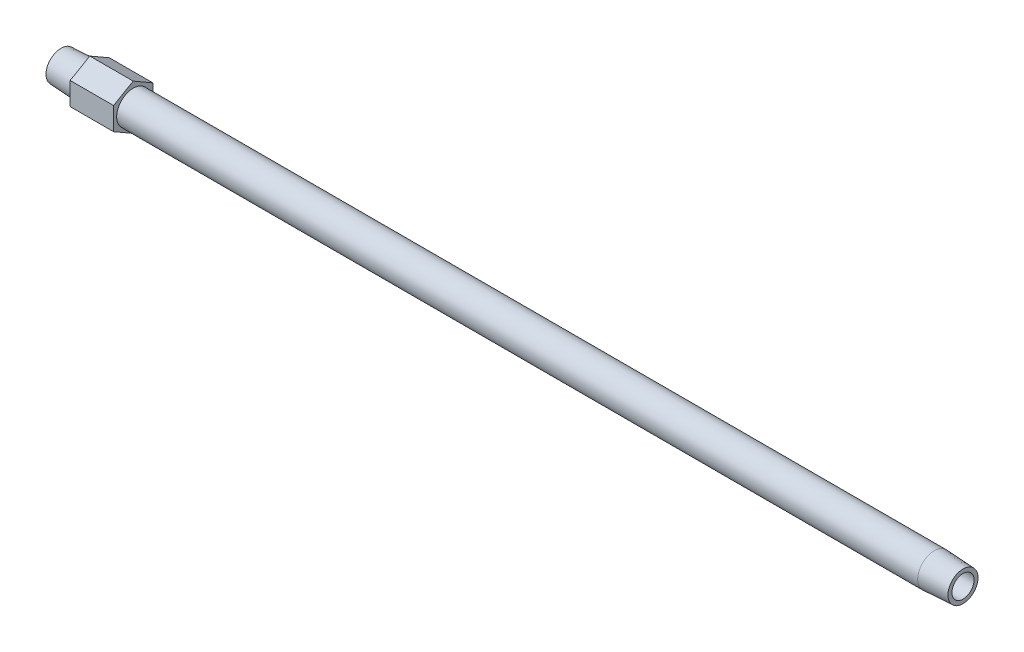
ISO-10303-21;
HEADER;
FILE_DESCRIPTION(('STEP AP214'),'2;1');
FILE_NAME('part.step','',(''),(''),'','','');
FILE_SCHEMA(('AUTOMOTIVE_DESIGN { 1 0 10303 214 1 1 1 1 }'));
ENDSEC;
DATA;
#1=APPLICATION_CONTEXT('core data for automotive mechanical design processes');
#2=APPLICATION_PROTOCOL_DEFINITION('international standard','automotive_design',2000,#1);
#3=PRODUCT_CONTEXT('',#1,'mechanical');
#4=PRODUCT('Part','Part','',(#3));
#5=PRODUCT_RELATED_PRODUCT_CATEGORY('part','',(#4));
#6=PRODUCT_DEFINITION_FORMATION('','',#4);
#7=PRODUCT_DEFINITION_CONTEXT('part definition',#1,'design');
#8=PRODUCT_DEFINITION('design','',#6,#7);
#9=PRODUCT_DEFINITION_SHAPE('','',#8);
#10=(LENGTH_UNIT() NAMED_UNIT(*) SI_UNIT(.MILLI.,.METRE.));
#11=(NAMED_UNIT(*) PLANE_ANGLE_UNIT() SI_UNIT($,.RADIAN.));
#12=(NAMED_UNIT(*) SI_UNIT($,.STERADIAN.) SOLID_ANGLE_UNIT());
#13=UNCERTAINTY_MEASURE_WITH_UNIT(LENGTH_MEASURE(1.E-05),#10,'distance_accuracy_value','');
#14=(GEOMETRIC_REPRESENTATION_CONTEXT(3) GLOBAL_UNCERTAINTY_ASSIGNED_CONTEXT((#13)) GLOBAL_UNIT_ASSIGNED_CONTEXT((#10,
#11,#12)) REPRESENTATION_CONTEXT('',''));
#15=CARTESIAN_POINT('',(0.,0.,0.));
#16=DIRECTION('',(0.,0.,1.));
#17=DIRECTION('',(1.,0.,0.));
#18=AXIS2_PLACEMENT_3D('',#15,#16,#17);
#19=CARTESIAN_POINT('',(0.,0.,-3.59899397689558));
#20=DIRECTION('',(1.,0.,0.));
#21=DIRECTION('',(0.,0.,-1.));
#22=AXIS2_PLACEMENT_3D('',#19,#20,#21);
#23=PLANE('',#22);
#24=CARTESIAN_POINT('',(0.,0.,0.));
#25=DIRECTION('',(-1.,0.,0.));
#26=DIRECTION('',(0.,0.,1.));
#27=AXIS2_PLACEMENT_3D('',#24,#25,#26);
#28=CIRCLE('',#27,3.59899397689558);
#29=CARTESIAN_POINT('',(0.,0.,3.59899397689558));
#30=VERTEX_POINT('',#29);
#31=EDGE_CURVE('E147',#30,#30,#28,.T.);
#32=ORIENTED_EDGE('',*,*,#31,.T.);
#33=EDGE_LOOP('',(#32));
#34=FACE_BOUND('',#33,.T.);
#35=CARTESIAN_POINT('',(0.,0.,0.));
#36=DIRECTION('',(1.,0.,0.));
#37=DIRECTION('',(0.,0.,1.));
#38=AXIS2_PLACEMENT_3D('',#35,#36,#37);
#39=CIRCLE('',#38,2.6543);
#40=CARTESIAN_POINT('',(0.,0.,2.6543));
#41=VERTEX_POINT('',#40);
#42=EDGE_CURVE('E159',#41,#41,#39,.T.);
#43=ORIENTED_EDGE('',*,*,#42,.T.);
#44=EDGE_LOOP('',(#43));
#45=FACE_BOUND('',#44,.T.);
#46=ADVANCED_FACE('F15',(#34,#45),#23,.F.);
#47=CARTESIAN_POINT('',(215.9,0.,-3.59899397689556));
#48=DIRECTION('',(-1.,0.,0.));
#49=DIRECTION('',(0.,0.,1.));
#50=AXIS2_PLACEMENT_3D('',#47,#48,#49);
#51=PLANE('',#50);
#52=CARTESIAN_POINT('',(215.9,0.,0.));
#53=DIRECTION('',(-1.,0.,0.));
#54=DIRECTION('',(0.,0.,1.));
#55=AXIS2_PLACEMENT_3D('',#52,#53,#54);
#56=CIRCLE('',#55,3.59899397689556);
#57=CARTESIAN_POINT('',(215.9,0.,3.59899397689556));
#58=VERTEX_POINT('',#57);
#59=EDGE_CURVE('E150',#58,#58,#56,.T.);
#60=ORIENTED_EDGE('',*,*,#59,.F.);
#61=EDGE_LOOP('',(#60));
#62=FACE_BOUND('',#61,.T.);
#63=CARTESIAN_POINT('',(215.9,0.,0.));
#64=DIRECTION('',(-1.,0.,0.));
#65=DIRECTION('',(0.,0.,1.));
#66=AXIS2_PLACEMENT_3D('',#63,#64,#65);
#67=CIRCLE('',#66,2.6543);
#68=CARTESIAN_POINT('',(215.9,0.,2.6543));
#69=VERTEX_POINT('',#68);
#70=EDGE_CURVE('E156',#69,#69,#67,.F.);
#71=ORIENTED_EDGE('',*,*,#70,.F.);
#72=EDGE_LOOP('',(#71));
#73=FACE_BOUND('',#72,.T.);
#74=ADVANCED_FACE('F178',(#62,#73),#51,.F.);
#75=CARTESIAN_POINT('',(17.272,-2.71296891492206,-4.699));
#76=DIRECTION('',(1.,0.,0.));
#77=DIRECTION('',(0.,1.,0.));
#78=AXIS2_PLACEMENT_3D('',#75,#76,#77);
#79=PLANE('',#78);
#80=DIRECTION('',(0.,0.5,-0.866025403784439));
#81=VECTOR('',#80,1.);
#82=CARTESIAN_POINT('',(17.272,-5.4259378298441,0.));
#83=LINE('',#82,#81);
#84=CARTESIAN_POINT('',(17.272,-5.4259378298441,0.));
#85=VERTEX_POINT('',#84);
#86=CARTESIAN_POINT('',(17.272,-2.71296891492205,-4.699));
#87=VERTEX_POINT('',#86);
#88=EDGE_CURVE('E103',#85,#87,#83,.T.);
#89=ORIENTED_EDGE('',*,*,#88,.T.);
#90=DIRECTION('',(0.,1.,0.));
#91=VECTOR('',#90,1.);
#92=CARTESIAN_POINT('',(17.272,-2.71296891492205,-4.699));
#93=LINE('',#92,#91);
#94=CARTESIAN_POINT('',(17.272,2.71296891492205,-4.699));
#95=VERTEX_POINT('',#94);
#96=EDGE_CURVE('E83',#87,#95,#93,.T.);
#97=ORIENTED_EDGE('',*,*,#96,.T.);
#98=DIRECTION('',(0.,0.5,0.866025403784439));
#99=VECTOR('',#98,1.);
#100=CARTESIAN_POINT('',(17.272,2.71296891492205,-4.699));
#101=LINE('',#100,#99);
#102=CARTESIAN_POINT('',(17.272,5.4259378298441,0.));
#103=VERTEX_POINT('',#102);
#104=EDGE_CURVE('E102',#95,#103,#101,.T.);
#105=ORIENTED_EDGE('',*,*,#104,.T.);
#106=DIRECTION('',(0.,-0.5,0.866025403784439));
#107=VECTOR('',#106,1.);
#108=CARTESIAN_POINT('',(17.272,5.4259378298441,0.));
#109=LINE('',#108,#107);
#110=CARTESIAN_POINT('',(17.272,2.71296891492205,4.699));
#111=VERTEX_POINT('',#110);
#112=EDGE_CURVE('E105',#103,#111,#109,.T.);
#113=ORIENTED_EDGE('',*,*,#112,.T.);
#114=DIRECTION('',(0.,-1.,0.));
#115=VECTOR('',#114,1.);
#116=CARTESIAN_POINT('',(17.272,2.71296891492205,4.699));
#117=LINE('',#116,#115);
#118=CARTESIAN_POINT('',(17.272,-2.71296891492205,4.699));
#119=VERTEX_POINT('',#118);
#120=EDGE_CURVE('E35',#111,#119,#117,.T.);
#121=ORIENTED_EDGE('',*,*,#120,.T.);
#122=DIRECTION('',(0.,-0.5,-0.866025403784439));
#123=VECTOR('',#122,1.);
#124=CARTESIAN_POINT('',(17.272,-2.71296891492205,4.699));
#125=LINE('',#124,#123);
#126=EDGE_CURVE('E30',#119,#85,#125,.T.);
#127=ORIENTED_EDGE('',*,*,#126,.T.);
#128=EDGE_LOOP('',(#89,#97,#105,#113,#121,#127));
#129=FACE_BOUND('',#128,.T.);
#130=CARTESIAN_POINT('',(17.272,0.,0.));
#131=DIRECTION('',(1.,0.,0.));
#132=DIRECTION('',(0.,1.,0.));
#133=AXIS2_PLACEMENT_3D('',#130,#131,#132);
#134=CIRCLE('',#133,3.95973768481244);
#135=CARTESIAN_POINT('',(17.272,3.95973768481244,0.));
#136=VERTEX_POINT('',#135);
#137=EDGE_CURVE('E89',#136,#136,#134,.F.);
#138=ORIENTED_EDGE('',*,*,#137,.T.);
#139=EDGE_LOOP('',(#138));
#140=FACE_BOUND('',#139,.T.);
#141=ADVANCED_FACE('F124',(#129,#140),#79,.T.);
#142=CARTESIAN_POINT('',(6.8834,-2.71296891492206,-4.699));
#143=DIRECTION('',(1.,0.,0.));
#144=DIRECTION('',(0.,1.,0.));
#145=AXIS2_PLACEMENT_3D('',#142,#143,#144);
#146=PLANE('',#145);
#147=DIRECTION('',(0.,0.5,-0.866025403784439));
#148=VECTOR('',#147,1.);
#149=CARTESIAN_POINT('',(6.8834,-5.4259378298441,0.));
#150=LINE('',#149,#148);
#151=CARTESIAN_POINT('',(6.8834,-5.4259378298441,0.));
#152=VERTEX_POINT('',#151);
#153=CARTESIAN_POINT('',(6.8834,-2.71296891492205,-4.699));
#154=VERTEX_POINT('',#153);
#155=EDGE_CURVE('E73',#152,#154,#150,.T.);
#156=ORIENTED_EDGE('',*,*,#155,.F.);
#157=DIRECTION('',(0.,-0.5,-0.866025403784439));
#158=VECTOR('',#157,1.);
#159=CARTESIAN_POINT('',(6.8834,-2.71296891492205,4.699));
#160=LINE('',#159,#158);
#161=CARTESIAN_POINT('',(6.8834,-2.71296891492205,4.699));
#162=VERTEX_POINT('',#161);
#163=EDGE_CURVE('E99',#162,#152,#160,.T.);
#164=ORIENTED_EDGE('',*,*,#163,.F.);
#165=DIRECTION('',(0.,-1.,0.));
#166=VECTOR('',#165,1.);
#167=CARTESIAN_POINT('',(6.8834,2.71296891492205,4.699));
#168=LINE('',#167,#166);
#169=CARTESIAN_POINT('',(6.8834,2.71296891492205,4.699));
#170=VERTEX_POINT('',#169);
#171=EDGE_CURVE('E133',#170,#162,#168,.T.);
#172=ORIENTED_EDGE('',*,*,#171,.F.);
#173=DIRECTION('',(0.,-0.5,0.866025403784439));
#174=VECTOR('',#173,1.);
#175=CARTESIAN_POINT('',(6.8834,5.4259378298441,0.));
#176=LINE('',#175,#174);
#177=CARTESIAN_POINT('',(6.8834,5.4259378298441,0.));
#178=VERTEX_POINT('',#177);
#179=EDGE_CURVE('E129',#178,#170,#176,.T.);
#180=ORIENTED_EDGE('',*,*,#179,.F.);
#181=DIRECTION('',(0.,0.5,0.866025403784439));
#182=VECTOR('',#181,1.);
#183=CARTESIAN_POINT('',(6.8834,2.71296891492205,-4.699));
#184=LINE('',#183,#182);
#185=CARTESIAN_POINT('',(6.8834,2.71296891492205,-4.699));
#186=VERTEX_POINT('',#185);
#187=EDGE_CURVE('E75',#186,#178,#184,.T.);
#188=ORIENTED_EDGE('',*,*,#187,.F.);
#189=DIRECTION('',(0.,1.,0.));
#190=VECTOR('',#189,1.);
#191=CARTESIAN_POINT('',(6.8834,-2.71296891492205,-4.699));
#192=LINE('',#191,#190);
#193=EDGE_CURVE('E68',#154,#186,#192,.T.);
#194=ORIENTED_EDGE('',*,*,#193,.F.);
#195=EDGE_LOOP('',(#156,#164,#172,#180,#188,#194));
#196=FACE_BOUND('',#195,.T.);
#197=CARTESIAN_POINT('',(6.8834,0.,0.));
#198=DIRECTION('',(-1.,0.,0.));
#199=DIRECTION('',(0.,0.,1.));
#200=AXIS2_PLACEMENT_3D('',#197,#198,#199);
#201=CIRCLE('',#200,3.95973768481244);
#202=CARTESIAN_POINT('',(6.8834,0.,3.95973768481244));
#203=VERTEX_POINT('',#202);
#204=EDGE_CURVE('E95',#203,#203,#201,.T.);
#205=ORIENTED_EDGE('',*,*,#204,.F.);
#206=EDGE_LOOP('',(#205));
#207=FACE_BOUND('',#206,.T.);
#208=ADVANCED_FACE('F69',(#196,#207),#146,.F.);
#209=CARTESIAN_POINT('',(17.272,-5.4259378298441,0.));
#210=DIRECTION('',(0.,0.866025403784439,0.5));
#211=DIRECTION('',(0.,-0.5,0.866025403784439));
#212=AXIS2_PLACEMENT_3D('',#209,#210,#211);
#213=PLANE('',#212);
#214=ORIENTED_EDGE('',*,*,#155,.T.);
#215=DIRECTION('',(-1.,0.,0.));
#216=VECTOR('',#215,1.);
#217=CARTESIAN_POINT('',(17.272,-2.71296891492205,-4.699));
#218=LINE('',#217,#216);
#219=EDGE_CURVE('E10',#87,#154,#218,.T.);
#220=ORIENTED_EDGE('',*,*,#219,.F.);
#221=ORIENTED_EDGE('',*,*,#88,.F.);
#222=DIRECTION('',(-1.,0.,0.));
#223=VECTOR('',#222,1.);
#224=CARTESIAN_POINT('',(17.272,-5.4259378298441,0.));
#225=LINE('',#224,#223);
#226=EDGE_CURVE('E87',#85,#152,#225,.T.);
#227=ORIENTED_EDGE('',*,*,#226,.T.);
#228=EDGE_LOOP('',(#214,#220,#221,#227));
#229=FACE_BOUND('',#228,.T.);
#230=ADVANCED_FACE('F17',(#229),#213,.F.);
#231=CARTESIAN_POINT('',(17.272,-2.71296891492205,-4.699));
#232=DIRECTION('',(0.,0.,1.));
#233=DIRECTION('',(1.,0.,0.));
#234=AXIS2_PLACEMENT_3D('',#231,#232,#233);
#235=PLANE('',#234);
#236=ORIENTED_EDGE('',*,*,#193,.T.);
#237=DIRECTION('',(-1.,0.,0.));
#238=VECTOR('',#237,1.);
#239=CARTESIAN_POINT('',(17.272,2.71296891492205,-4.699));
#240=LINE('',#239,#238);
#241=EDGE_CURVE('E23',#95,#186,#240,.T.);
#242=ORIENTED_EDGE('',*,*,#241,.F.);
#243=ORIENTED_EDGE('',*,*,#96,.F.);
#244=ORIENTED_EDGE('',*,*,#219,.T.);
#245=EDGE_LOOP('',(#236,#242,#243,#244));
#246=FACE_BOUND('',#245,.T.);
#247=ADVANCED_FACE('F82',(#246),#235,.F.);
#248=CARTESIAN_POINT('',(17.272,2.71296891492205,-4.699));
#249=DIRECTION('',(0.,-0.866025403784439,0.5));
#250=DIRECTION('',(0.,-0.5,-0.866025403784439));
#251=AXIS2_PLACEMENT_3D('',#248,#249,#250);
#252=PLANE('',#251);
#253=ORIENTED_EDGE('',*,*,#187,.T.);
#254=DIRECTION('',(-1.,0.,0.));
#255=VECTOR('',#254,1.);
#256=CARTESIAN_POINT('',(17.272,5.4259378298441,0.));
#257=LINE('',#256,#255);
#258=EDGE_CURVE('E117',#103,#178,#257,.T.);
#259=ORIENTED_EDGE('',*,*,#258,.F.);
#260=ORIENTED_EDGE('',*,*,#104,.F.);
#261=ORIENTED_EDGE('',*,*,#241,.T.);
#262=EDGE_LOOP('',(#253,#259,#260,#261));
#263=FACE_BOUND('',#262,.T.);
#264=ADVANCED_FACE('F121',(#263),#252,.F.);
#265=CARTESIAN_POINT('',(17.272,5.4259378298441,0.));
#266=DIRECTION('',(0.,-0.866025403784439,-0.5));
#267=DIRECTION('',(0.,0.5,-0.866025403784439));
#268=AXIS2_PLACEMENT_3D('',#265,#266,#267);
#269=PLANE('',#268);
#270=ORIENTED_EDGE('',*,*,#179,.T.);
#271=DIRECTION('',(-1.,0.,0.));
#272=VECTOR('',#271,1.);
#273=CARTESIAN_POINT('',(17.272,2.71296891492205,4.699));
#274=LINE('',#273,#272);
#275=EDGE_CURVE('E114',#111,#170,#274,.T.);
#276=ORIENTED_EDGE('',*,*,#275,.F.);
#277=ORIENTED_EDGE('',*,*,#112,.F.);
#278=ORIENTED_EDGE('',*,*,#258,.T.);
#279=EDGE_LOOP('',(#270,#276,#277,#278));
#280=FACE_BOUND('',#279,.T.);
#281=ADVANCED_FACE('F128',(#280),#269,.F.);
#282=CARTESIAN_POINT('',(17.272,2.71296891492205,4.699));
#283=DIRECTION('',(0.,0.,-1.));
#284=DIRECTION('',(-1.,0.,0.));
#285=AXIS2_PLACEMENT_3D('',#282,#283,#284);
#286=PLANE('',#285);
#287=ORIENTED_EDGE('',*,*,#171,.T.);
#288=DIRECTION('',(-1.,0.,0.));
#289=VECTOR('',#288,1.);
#290=CARTESIAN_POINT('',(17.272,-2.71296891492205,4.699));
#291=LINE('',#290,#289);
#292=EDGE_CURVE('E111',#119,#162,#291,.T.);
#293=ORIENTED_EDGE('',*,*,#292,.F.);
#294=ORIENTED_EDGE('',*,*,#120,.F.);
#295=ORIENTED_EDGE('',*,*,#275,.T.);
#296=EDGE_LOOP('',(#287,#293,#294,#295));
#297=FACE_BOUND('',#296,.T.);
#298=ADVANCED_FACE('F132',(#297),#286,.F.);
#299=CARTESIAN_POINT('',(17.272,-2.71296891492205,4.699));
#300=DIRECTION('',(0.,0.866025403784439,-0.5));
#301=DIRECTION('',(0.,0.5,0.866025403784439));
#302=AXIS2_PLACEMENT_3D('',#299,#300,#301);
#303=PLANE('',#302);
#304=ORIENTED_EDGE('',*,*,#163,.T.);
#305=ORIENTED_EDGE('',*,*,#226,.F.);
#306=ORIENTED_EDGE('',*,*,#126,.F.);
#307=ORIENTED_EDGE('',*,*,#292,.T.);
#308=EDGE_LOOP('',(#304,#305,#306,#307));
#309=FACE_BOUND('',#308,.T.);
#310=ADVANCED_FACE('F135',(#309),#303,.F.);
#311=CARTESIAN_POINT('',(6.8834,0.,0.));
#312=DIRECTION('',(1.,0.,0.));
#313=DIRECTION('',(0.,0.,-1.));
#314=AXIS2_PLACEMENT_3D('',#311,#312,#313);
#315=CONICAL_SURFACE('',#314,3.95973768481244,0.0523598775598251);
#316=ORIENTED_EDGE('',*,*,#31,.F.);
#317=EDGE_LOOP('',(#316));
#318=FACE_BOUND('',#317,.T.);
#319=ORIENTED_EDGE('',*,*,#204,.T.);
#320=EDGE_LOOP('',(#319));
#321=FACE_BOUND('',#320,.T.);
#322=ADVANCED_FACE('F187',(#318,#321),#315,.T.);
#323=CARTESIAN_POINT('',(-60.,0.,0.));
#324=DIRECTION('',(-1.,0.,0.));
#325=DIRECTION('',(0.,0.,1.));
#326=AXIS2_PLACEMENT_3D('',#323,#324,#325);
#327=CYLINDRICAL_SURFACE('',#326,3.95973768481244);
#328=ORIENTED_EDGE('',*,*,#137,.F.);
#329=EDGE_LOOP('',(#328));
#330=FACE_BOUND('',#329,.T.);
#331=CARTESIAN_POINT('',(209.0166,0.,0.));
#332=DIRECTION('',(-1.,0.,0.));
#333=DIRECTION('',(0.,0.,1.));
#334=AXIS2_PLACEMENT_3D('',#331,#332,#333);
#335=CIRCLE('',#334,3.95973768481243);
#336=CARTESIAN_POINT('',(209.0166,0.,3.95973768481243));
#337=VERTEX_POINT('',#336);
#338=EDGE_CURVE('E153',#337,#337,#335,.T.);
#339=ORIENTED_EDGE('',*,*,#338,.T.);
#340=EDGE_LOOP('',(#339));
#341=FACE_BOUND('',#340,.T.);
#342=ADVANCED_FACE('F174',(#330,#341),#327,.T.);
#343=CARTESIAN_POINT('',(215.9,0.,0.));
#344=DIRECTION('',(-1.,0.,0.));
#345=DIRECTION('',(0.,0.,1.));
#346=AXIS2_PLACEMENT_3D('',#343,#344,#345);
#347=CONICAL_SURFACE('',#346,3.59899397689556,0.0523598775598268);
#348=ORIENTED_EDGE('',*,*,#338,.F.);
#349=EDGE_LOOP('',(#348));
#350=FACE_BOUND('',#349,.T.);
#351=ORIENTED_EDGE('',*,*,#59,.T.);
#352=EDGE_LOOP('',(#351));
#353=FACE_BOUND('',#352,.T.);
#354=ADVANCED_FACE('F167',(#350,#353),#347,.T.);
#355=CARTESIAN_POINT('',(216.376744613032,0.,0.));
#356=DIRECTION('',(-1.,0.,0.));
#357=DIRECTION('',(0.,0.,1.));
#358=AXIS2_PLACEMENT_3D('',#355,#356,#357);
#359=CYLINDRICAL_SURFACE('',#358,2.6543);
#360=ORIENTED_EDGE('',*,*,#70,.T.);
#361=EDGE_LOOP('',(#360));
#362=FACE_BOUND('',#361,.T.);
#363=ORIENTED_EDGE('',*,*,#42,.F.);
#364=EDGE_LOOP('',(#363));
#365=FACE_BOUND('',#364,.T.);
#366=ADVANCED_FACE('F165',(#362,#365),#359,.F.);
#367=CLOSED_SHELL('',(#46,#74,#141,#208,#230,#247,#264,#281,#298,#310,#322,#342,#354,#366));
#368=MANIFOLD_SOLID_BREP('B1',#367);
#369=ADVANCED_BREP_SHAPE_REPRESENTATION('',(#18,#368),#14);
#370=SHAPE_DEFINITION_REPRESENTATION(#9,#369);
ENDSEC;
END-ISO-10303-21;
